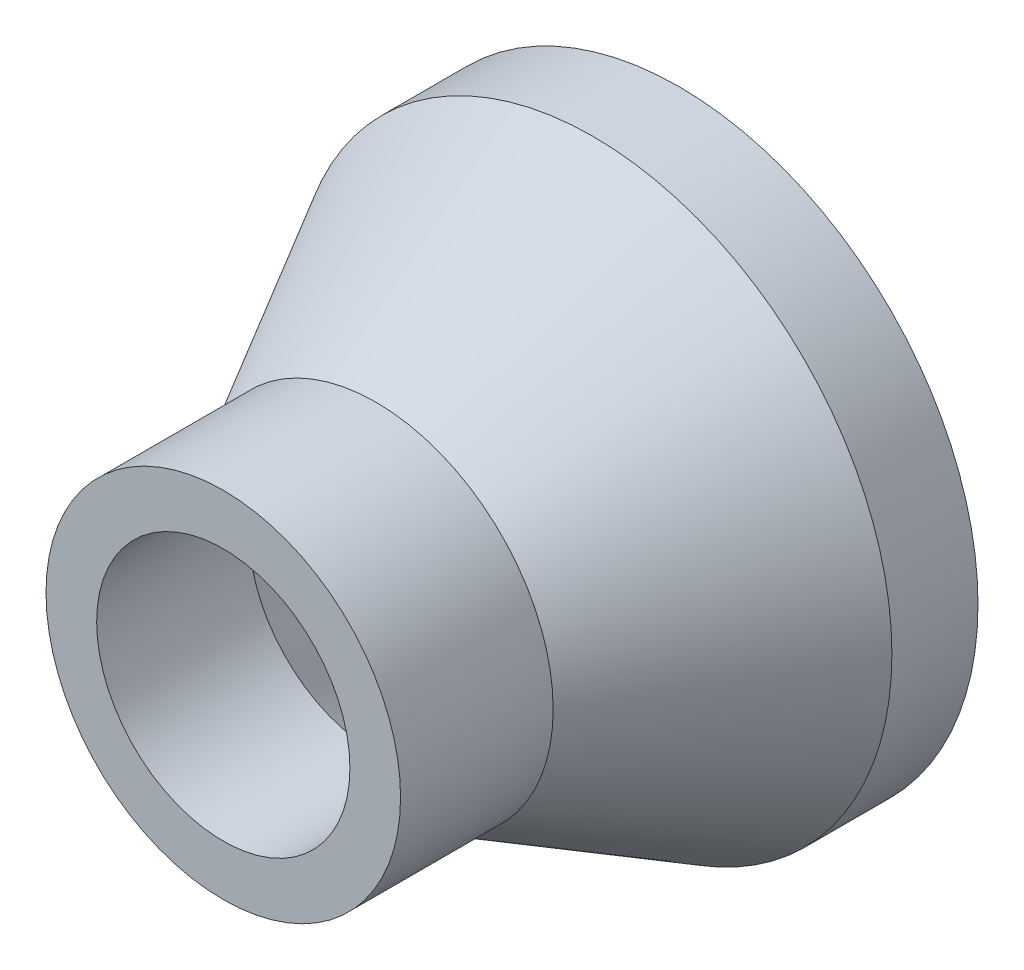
ISO-10303-21;
HEADER;
FILE_DESCRIPTION(('STEP AP214'),'2;1');
FILE_NAME('part.step','',(''),(''),'','','');
FILE_SCHEMA(('AUTOMOTIVE_DESIGN { 1 0 10303 214 1 1 1 1 }'));
ENDSEC;
DATA;
#1=APPLICATION_CONTEXT('core data for automotive mechanical design processes');
#2=APPLICATION_PROTOCOL_DEFINITION('international standard','automotive_design',2000,#1);
#3=PRODUCT_CONTEXT('',#1,'mechanical');
#4=PRODUCT('Part','Part','',(#3));
#5=PRODUCT_RELATED_PRODUCT_CATEGORY('part','',(#4));
#6=PRODUCT_DEFINITION_FORMATION('','',#4);
#7=PRODUCT_DEFINITION_CONTEXT('part definition',#1,'design');
#8=PRODUCT_DEFINITION('design','',#6,#7);
#9=PRODUCT_DEFINITION_SHAPE('','',#8);
#10=(LENGTH_UNIT() NAMED_UNIT(*) SI_UNIT(.MILLI.,.METRE.));
#11=(NAMED_UNIT(*) PLANE_ANGLE_UNIT() SI_UNIT($,.RADIAN.));
#12=(NAMED_UNIT(*) SI_UNIT($,.STERADIAN.) SOLID_ANGLE_UNIT());
#13=UNCERTAINTY_MEASURE_WITH_UNIT(LENGTH_MEASURE(1.E-05),#10,'distance_accuracy_value','');
#14=(GEOMETRIC_REPRESENTATION_CONTEXT(3) GLOBAL_UNCERTAINTY_ASSIGNED_CONTEXT((#13)) GLOBAL_UNIT_ASSIGNED_CONTEXT((#10,
#11,#12)) REPRESENTATION_CONTEXT('',''));
#15=CARTESIAN_POINT('',(0.,0.,0.));
#16=DIRECTION('',(0.,0.,1.));
#17=DIRECTION('',(1.,0.,0.));
#18=AXIS2_PLACEMENT_3D('',#15,#16,#17);
#19=CARTESIAN_POINT('',(0.,0.,1.7));
#20=DIRECTION('',(0.,0.,-1.));
#21=DIRECTION('',(-1.,0.,0.));
#22=AXIS2_PLACEMENT_3D('',#19,#20,#21);
#23=CONICAL_SURFACE('',#22,5.9,0.510308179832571);
#24=CARTESIAN_POINT('',(0.,0.,5.98752584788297));
#25=DIRECTION('',(0.,0.,-1.));
#26=DIRECTION('',(-1.,0.,0.));
#27=AXIS2_PLACEMENT_3D('',#24,#25,#26);
#28=CIRCLE('',#27,3.5);
#29=CARTESIAN_POINT('',(-3.5,0.,5.98752584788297));
#30=VERTEX_POINT('',#29);
#31=EDGE_CURVE('E59',#30,#30,#28,.T.);
#32=ORIENTED_EDGE('',*,*,#31,.T.);
#33=EDGE_LOOP('',(#32));
#34=FACE_BOUND('',#33,.T.);
#35=CARTESIAN_POINT('',(0.,0.,1.7));
#36=DIRECTION('',(0.,0.,-1.));
#37=DIRECTION('',(-1.,0.,0.));
#38=AXIS2_PLACEMENT_3D('',#35,#36,#37);
#39=CIRCLE('',#38,5.9);
#40=CARTESIAN_POINT('',(-5.9,0.,1.7));
#41=VERTEX_POINT('',#40);
#42=EDGE_CURVE('E10',#41,#41,#39,.T.);
#43=ORIENTED_EDGE('',*,*,#42,.F.);
#44=EDGE_LOOP('',(#43));
#45=FACE_BOUND('',#44,.T.);
#46=ADVANCED_FACE('F31',(#34,#45),#23,.T.);
#47=CARTESIAN_POINT('',(0.,0.,-14.9633663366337));
#48=DIRECTION('',(0.,0.,-1.));
#49=DIRECTION('',(-1.,0.,0.));
#50=AXIS2_PLACEMENT_3D('',#47,#48,#49);
#51=CYLINDRICAL_SURFACE('',#50,5.9);
#52=ORIENTED_EDGE('',*,*,#42,.T.);
#53=EDGE_LOOP('',(#52));
#54=FACE_BOUND('',#53,.T.);
#55=CARTESIAN_POINT('',(0.,0.,0.));
#56=DIRECTION('',(0.,0.,-1.));
#57=DIRECTION('',(-1.,0.,0.));
#58=AXIS2_PLACEMENT_3D('',#55,#56,#57);
#59=CIRCLE('',#58,5.9);
#60=CARTESIAN_POINT('',(-5.9,0.,0.));
#61=VERTEX_POINT('',#60);
#62=EDGE_CURVE('E37',#61,#61,#59,.T.);
#63=ORIENTED_EDGE('',*,*,#62,.F.);
#64=EDGE_LOOP('',(#63));
#65=FACE_BOUND('',#64,.T.);
#66=ADVANCED_FACE('F77',(#54,#65),#51,.T.);
#67=CARTESIAN_POINT('',(0.,5.9,0.));
#68=DIRECTION('',(0.,0.,-1.));
#69=DIRECTION('',(-1.,0.,0.));
#70=AXIS2_PLACEMENT_3D('',#67,#68,#69);
#71=PLANE('',#70);
#72=ORIENTED_EDGE('',*,*,#62,.T.);
#73=EDGE_LOOP('',(#72));
#74=FACE_BOUND('',#73,.T.);
#75=CARTESIAN_POINT('',(0.,0.,0.));
#76=DIRECTION('',(0.,0.,-1.));
#77=DIRECTION('',(-1.,0.,0.));
#78=AXIS2_PLACEMENT_3D('',#75,#76,#77);
#79=CIRCLE('',#78,4.9);
#80=CARTESIAN_POINT('',(-4.9,0.,0.));
#81=VERTEX_POINT('',#80);
#82=EDGE_CURVE('E41',#81,#81,#79,.T.);
#83=ORIENTED_EDGE('',*,*,#82,.F.);
#84=EDGE_LOOP('',(#83));
#85=FACE_BOUND('',#84,.T.);
#86=ADVANCED_FACE('F81',(#74,#85),#71,.T.);
#87=CARTESIAN_POINT('',(0.,0.,-14.9633663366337));
#88=DIRECTION('',(0.,0.,-1.));
#89=DIRECTION('',(-1.,0.,0.));
#90=AXIS2_PLACEMENT_3D('',#87,#88,#89);
#91=CYLINDRICAL_SURFACE('',#90,4.9);
#92=ORIENTED_EDGE('',*,*,#82,.T.);
#93=EDGE_LOOP('',(#92));
#94=FACE_BOUND('',#93,.T.);
#95=CARTESIAN_POINT('',(0.,0.,1.7));
#96=DIRECTION('',(0.,0.,-1.));
#97=DIRECTION('',(-1.,0.,0.));
#98=AXIS2_PLACEMENT_3D('',#95,#96,#97);
#99=CIRCLE('',#98,4.9);
#100=CARTESIAN_POINT('',(-4.9,0.,1.7));
#101=VERTEX_POINT('',#100);
#102=EDGE_CURVE('E45',#101,#101,#99,.T.);
#103=ORIENTED_EDGE('',*,*,#102,.F.);
#104=EDGE_LOOP('',(#103));
#105=FACE_BOUND('',#104,.T.);
#106=ADVANCED_FACE('F85',(#94,#105),#91,.F.);
#107=CARTESIAN_POINT('',(0.,0.,5.98752584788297));
#108=DIRECTION('',(0.,0.,-1.));
#109=DIRECTION('',(-1.,0.,0.));
#110=AXIS2_PLACEMENT_3D('',#107,#108,#109);
#111=CONICAL_SURFACE('',#110,2.5,0.510308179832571);
#112=ORIENTED_EDGE('',*,*,#102,.T.);
#113=EDGE_LOOP('',(#112));
#114=FACE_BOUND('',#113,.T.);
#115=CARTESIAN_POINT('',(0.,0.,5.98752584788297));
#116=DIRECTION('',(0.,0.,-1.));
#117=DIRECTION('',(-1.,0.,0.));
#118=AXIS2_PLACEMENT_3D('',#115,#116,#117);
#119=CIRCLE('',#118,2.5);
#120=CARTESIAN_POINT('',(-2.5,0.,5.98752584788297));
#121=VERTEX_POINT('',#120);
#122=EDGE_CURVE('E50',#121,#121,#119,.T.);
#123=ORIENTED_EDGE('',*,*,#122,.F.);
#124=EDGE_LOOP('',(#123));
#125=FACE_BOUND('',#124,.T.);
#126=ADVANCED_FACE('F91',(#114,#125),#111,.F.);
#127=CARTESIAN_POINT('',(0.,0.,-14.9633663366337));
#128=DIRECTION('',(0.,0.,-1.));
#129=DIRECTION('',(-1.,0.,0.));
#130=AXIS2_PLACEMENT_3D('',#127,#128,#129);
#131=CYLINDRICAL_SURFACE('',#130,2.5);
#132=ORIENTED_EDGE('',*,*,#122,.T.);
#133=EDGE_LOOP('',(#132));
#134=FACE_BOUND('',#133,.T.);
#135=CARTESIAN_POINT('',(0.,0.,9.));
#136=DIRECTION('',(0.,0.,-1.));
#137=DIRECTION('',(-1.,0.,0.));
#138=AXIS2_PLACEMENT_3D('',#135,#136,#137);
#139=CIRCLE('',#138,2.5);
#140=CARTESIAN_POINT('',(-2.5,0.,9.));
#141=VERTEX_POINT('',#140);
#142=EDGE_CURVE('E53',#141,#141,#139,.T.);
#143=ORIENTED_EDGE('',*,*,#142,.F.);
#144=EDGE_LOOP('',(#143));
#145=FACE_BOUND('',#144,.T.);
#146=ADVANCED_FACE('F73',(#134,#145),#131,.F.);
#147=CARTESIAN_POINT('',(0.,2.5,9.));
#148=DIRECTION('',(0.,0.,1.));
#149=DIRECTION('',(1.,0.,0.));
#150=AXIS2_PLACEMENT_3D('',#147,#148,#149);
#151=PLANE('',#150);
#152=ORIENTED_EDGE('',*,*,#142,.T.);
#153=EDGE_LOOP('',(#152));
#154=FACE_BOUND('',#153,.T.);
#155=CARTESIAN_POINT('',(0.,0.,9.));
#156=DIRECTION('',(0.,0.,-1.));
#157=DIRECTION('',(-1.,0.,0.));
#158=AXIS2_PLACEMENT_3D('',#155,#156,#157);
#159=CIRCLE('',#158,3.5);
#160=CARTESIAN_POINT('',(-3.5,0.,9.));
#161=VERTEX_POINT('',#160);
#162=EDGE_CURVE('E56',#161,#161,#159,.T.);
#163=ORIENTED_EDGE('',*,*,#162,.F.);
#164=EDGE_LOOP('',(#163));
#165=FACE_BOUND('',#164,.T.);
#166=ADVANCED_FACE('F67',(#154,#165),#151,.T.);
#167=CARTESIAN_POINT('',(0.,0.,-14.9633663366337));
#168=DIRECTION('',(0.,0.,-1.));
#169=DIRECTION('',(-1.,0.,0.));
#170=AXIS2_PLACEMENT_3D('',#167,#168,#169);
#171=CYLINDRICAL_SURFACE('',#170,3.5);
#172=ORIENTED_EDGE('',*,*,#162,.T.);
#173=EDGE_LOOP('',(#172));
#174=FACE_BOUND('',#173,.T.);
#175=ORIENTED_EDGE('',*,*,#31,.F.);
#176=EDGE_LOOP('',(#175));
#177=FACE_BOUND('',#176,.T.);
#178=ADVANCED_FACE('F65',(#174,#177),#171,.T.);
#179=CLOSED_SHELL('',(#46,#66,#86,#106,#126,#146,#166,#178));
#180=MANIFOLD_SOLID_BREP('B2',#179);
#181=ADVANCED_BREP_SHAPE_REPRESENTATION('',(#18,#180),#14);
#182=SHAPE_DEFINITION_REPRESENTATION(#9,#181);
ENDSEC;
END-ISO-10303-21;
